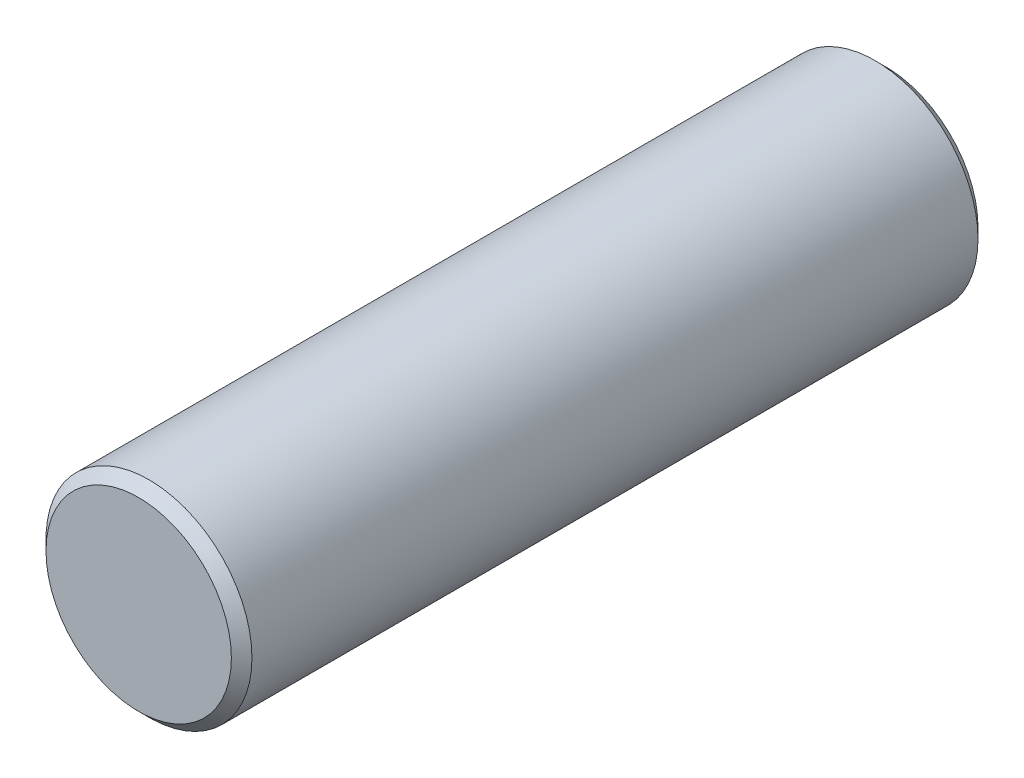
ISO-10303-21;
HEADER;
FILE_DESCRIPTION(('STEP AP214'),'2;1');
FILE_NAME('part.step','',(''),(''),'','','');
FILE_SCHEMA(('AUTOMOTIVE_DESIGN { 1 0 10303 214 1 1 1 1 }'));
ENDSEC;
DATA;
#1=APPLICATION_CONTEXT('core data for automotive mechanical design processes');
#2=APPLICATION_PROTOCOL_DEFINITION('international standard','automotive_design',2000,#1);
#3=PRODUCT_CONTEXT('',#1,'mechanical');
#4=PRODUCT('Part','Part','',(#3));
#5=PRODUCT_RELATED_PRODUCT_CATEGORY('part','',(#4));
#6=PRODUCT_DEFINITION_FORMATION('','',#4);
#7=PRODUCT_DEFINITION_CONTEXT('part definition',#1,'design');
#8=PRODUCT_DEFINITION('design','',#6,#7);
#9=PRODUCT_DEFINITION_SHAPE('','',#8);
#10=(LENGTH_UNIT() NAMED_UNIT(*) SI_UNIT(.MILLI.,.METRE.));
#11=(NAMED_UNIT(*) PLANE_ANGLE_UNIT() SI_UNIT($,.RADIAN.));
#12=(NAMED_UNIT(*) SI_UNIT($,.STERADIAN.) SOLID_ANGLE_UNIT());
#13=UNCERTAINTY_MEASURE_WITH_UNIT(LENGTH_MEASURE(1.E-05),#10,'distance_accuracy_value','');
#14=(GEOMETRIC_REPRESENTATION_CONTEXT(3) GLOBAL_UNCERTAINTY_ASSIGNED_CONTEXT((#13)) GLOBAL_UNIT_ASSIGNED_CONTEXT((#10,
#11,#12)) REPRESENTATION_CONTEXT('',''));
#15=CARTESIAN_POINT('',(0.,0.,0.));
#16=DIRECTION('',(0.,0.,1.));
#17=DIRECTION('',(1.,0.,0.));
#18=AXIS2_PLACEMENT_3D('',#15,#16,#17);
#19=CARTESIAN_POINT('',(31.25,56.0757599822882,-14.5));
#20=DIRECTION('',(0.,0.,-1.));
#21=DIRECTION('',(-1.,0.,0.));
#22=AXIS2_PLACEMENT_3D('',#19,#20,#21);
#23=PLANE('',#22);
#24=CARTESIAN_POINT('',(31.25,56.0757599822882,-14.5));
#25=DIRECTION('',(0.,0.,-1.));
#26=DIRECTION('',(-1.,0.,0.));
#27=AXIS2_PLACEMENT_3D('',#24,#25,#26);
#28=CIRCLE('',#27,1.8);
#29=CARTESIAN_POINT('',(29.45,56.0757599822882,-14.5));
#30=VERTEX_POINT('',#29);
#31=EDGE_CURVE('E10',#30,#30,#28,.T.);
#32=ORIENTED_EDGE('',*,*,#31,.T.);
#33=EDGE_LOOP('',(#32));
#34=FACE_BOUND('',#33,.T.);
#35=ADVANCED_FACE('F31',(#34),#23,.T.);
#36=CARTESIAN_POINT('',(31.25,56.0757599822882,0.));
#37=DIRECTION('',(0.,0.,1.));
#38=DIRECTION('',(1.,0.,0.));
#39=AXIS2_PLACEMENT_3D('',#36,#37,#38);
#40=PLANE('',#39);
#41=CARTESIAN_POINT('',(31.25,56.0757599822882,0.));
#42=DIRECTION('',(0.,0.,1.));
#43=DIRECTION('',(1.,0.,0.));
#44=AXIS2_PLACEMENT_3D('',#41,#42,#43);
#45=CIRCLE('',#44,1.8);
#46=CARTESIAN_POINT('',(33.05,56.0757599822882,0.));
#47=VERTEX_POINT('',#46);
#48=EDGE_CURVE('E46',#47,#47,#45,.T.);
#49=ORIENTED_EDGE('',*,*,#48,.T.);
#50=EDGE_LOOP('',(#49));
#51=FACE_BOUND('',#50,.T.);
#52=ADVANCED_FACE('F52',(#51),#40,.T.);
#53=CARTESIAN_POINT('',(31.25,56.0757599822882,-20.1568542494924));
#54=DIRECTION('',(0.,0.,1.));
#55=DIRECTION('',(1.,0.,0.));
#56=AXIS2_PLACEMENT_3D('',#53,#54,#55);
#57=CYLINDRICAL_SURFACE('',#56,2.);
#58=CARTESIAN_POINT('',(31.25,56.0757599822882,-0.199999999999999));
#59=DIRECTION('',(0.,0.,1.));
#60=DIRECTION('',(1.,0.,0.));
#61=AXIS2_PLACEMENT_3D('',#58,#59,#60);
#62=CIRCLE('',#61,2.);
#63=CARTESIAN_POINT('',(33.25,56.0757599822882,-0.199999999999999));
#64=VERTEX_POINT('',#63);
#65=EDGE_CURVE('E38',#64,#64,#62,.F.);
#66=ORIENTED_EDGE('',*,*,#65,.T.);
#67=EDGE_LOOP('',(#66));
#68=FACE_BOUND('',#67,.T.);
#69=CARTESIAN_POINT('',(31.25,56.0757599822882,-14.3));
#70=DIRECTION('',(0.,0.,-1.));
#71=DIRECTION('',(-1.,0.,0.));
#72=AXIS2_PLACEMENT_3D('',#69,#70,#71);
#73=CIRCLE('',#72,2.);
#74=CARTESIAN_POINT('',(29.25,56.0757599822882,-14.3));
#75=VERTEX_POINT('',#74);
#76=EDGE_CURVE('E42',#75,#75,#73,.F.);
#77=ORIENTED_EDGE('',*,*,#76,.T.);
#78=EDGE_LOOP('',(#77));
#79=FACE_BOUND('',#78,.T.);
#80=ADVANCED_FACE('F56',(#68,#79),#57,.T.);
#81=CARTESIAN_POINT('',(31.25,56.0757599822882,0.));
#82=DIRECTION('',(0.,0.,-1.));
#83=DIRECTION('',(-1.,0.,0.));
#84=AXIS2_PLACEMENT_3D('',#81,#82,#83);
#85=CONICAL_SURFACE('',#84,1.8,0.785398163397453);
#86=ORIENTED_EDGE('',*,*,#65,.F.);
#87=EDGE_LOOP('',(#86));
#88=FACE_BOUND('',#87,.T.);
#89=ORIENTED_EDGE('',*,*,#48,.F.);
#90=EDGE_LOOP('',(#89));
#91=FACE_BOUND('',#90,.T.);
#92=ADVANCED_FACE('F54',(#88,#91),#85,.T.);
#93=CARTESIAN_POINT('',(31.25,56.0757599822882,-14.3));
#94=DIRECTION('',(0.,0.,1.));
#95=DIRECTION('',(1.,0.,0.));
#96=AXIS2_PLACEMENT_3D('',#93,#94,#95);
#97=CONICAL_SURFACE('',#96,2.,0.785398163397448);
#98=ORIENTED_EDGE('',*,*,#31,.F.);
#99=EDGE_LOOP('',(#98));
#100=FACE_BOUND('',#99,.T.);
#101=ORIENTED_EDGE('',*,*,#76,.F.);
#102=EDGE_LOOP('',(#101));
#103=FACE_BOUND('',#102,.T.);
#104=ADVANCED_FACE('F33',(#100,#103),#97,.T.);
#105=CLOSED_SHELL('',(#35,#52,#80,#92,#104));
#106=MANIFOLD_SOLID_BREP('B2',#105);
#107=ADVANCED_BREP_SHAPE_REPRESENTATION('',(#18,#106),#14);
#108=SHAPE_DEFINITION_REPRESENTATION(#9,#107);
ENDSEC;
END-ISO-10303-21;
